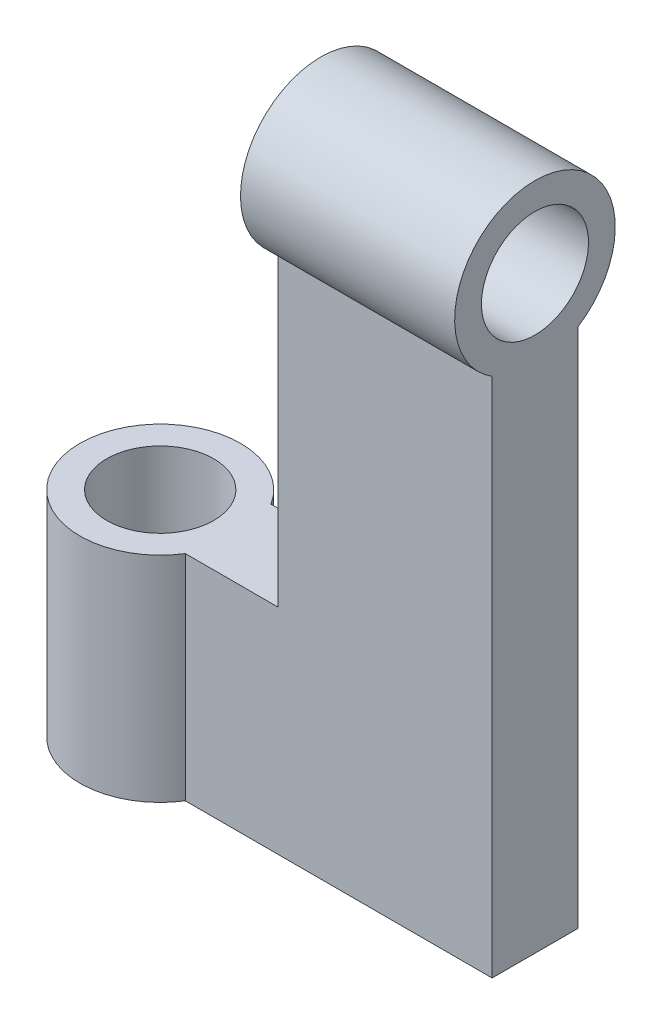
from build123d import *

# Parameters (mm, degrees)
BOSS_EXTRU_1_DEPTH = 8
ESQUISSE3_R        = 7.5
ESQUISSE3_R_2      = 5
BOSS_EXTRU_2_DEPTH = 20
ESQUISSE4_R        = 7.5
ESQUISSE4_R_2      = 5
BOSS_EXTRU_3_DEPTH = 20


with BuildPart() as part:
    # Esquisse1 → Boss.-Extru.1 (new body)
    with BuildSketch(Plane.XY):
        Polygon((-48.111553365, 32.885299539), (-68.111553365, 32.885299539), (-68.111553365, 2.885299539), (-78.111553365, 2.885299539), (-78.111553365, -17.114700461), (-48.111553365, -17.114700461), align=None)
    extrude(amount=BOSS_EXTRU_1_DEPTH)

    # Esquisse3 → Boss.-Extru.2 (add)
    with BuildSketch(Plane(origin=(-48.111553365, 0, 0), x_dir=(0, 0, -1), z_dir=(1, 0, 0))):
        with Locations((-4, 37.885299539)):
            Circle(ESQUISSE3_R)
        with Locations(Location((-4, 37.885299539, 0), (0, 0, 90))):
            Circle(ESQUISSE3_R_2, mode=Mode.SUBTRACT)
    extrude(amount=-BOSS_EXTRU_2_DEPTH)

    # Esquisse4 → Boss.-Extru.3 (add)
    with BuildSketch(Plane.XZ.offset(17.114700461)):
        with Locations((-83.111553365, 4)):
            Circle(ESQUISSE4_R)
        with Locations((-83.111553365, 4)):
            Circle(ESQUISSE4_R_2, mode=Mode.SUBTRACT)
    extrude(amount=-BOSS_EXTRU_3_DEPTH)


solid = part.part
